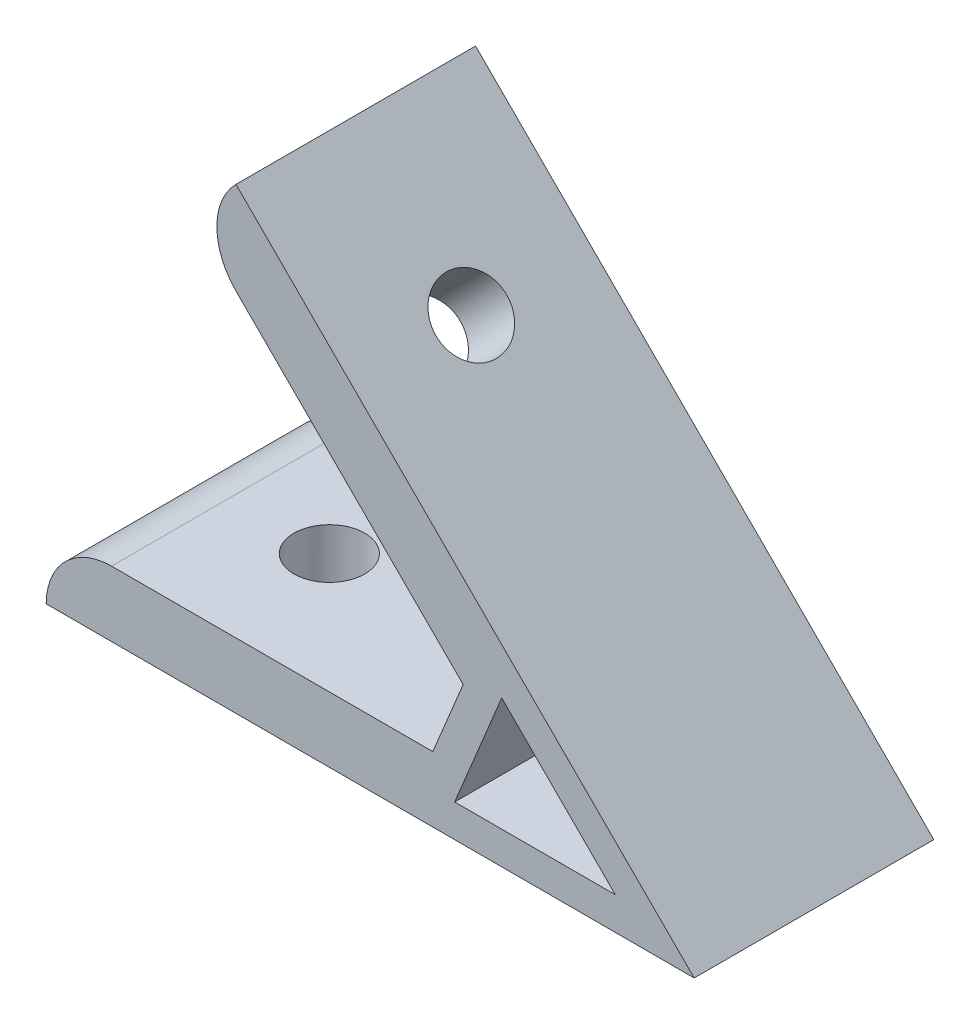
ISO-10303-21;
HEADER;
FILE_DESCRIPTION(('STEP AP214'),'2;1');
FILE_NAME('part.step','',(''),(''),'','','');
FILE_SCHEMA(('AUTOMOTIVE_DESIGN { 1 0 10303 214 1 1 1 1 }'));
ENDSEC;
DATA;
#1=APPLICATION_CONTEXT('core data for automotive mechanical design processes');
#2=APPLICATION_PROTOCOL_DEFINITION('international standard','automotive_design',2000,#1);
#3=PRODUCT_CONTEXT('',#1,'mechanical');
#4=PRODUCT('Part','Part','',(#3));
#5=PRODUCT_RELATED_PRODUCT_CATEGORY('part','',(#4));
#6=PRODUCT_DEFINITION_FORMATION('','',#4);
#7=PRODUCT_DEFINITION_CONTEXT('part definition',#1,'design');
#8=PRODUCT_DEFINITION('design','',#6,#7);
#9=PRODUCT_DEFINITION_SHAPE('','',#8);
#10=(LENGTH_UNIT() NAMED_UNIT(*) SI_UNIT(.MILLI.,.METRE.));
#11=(NAMED_UNIT(*) PLANE_ANGLE_UNIT() SI_UNIT($,.RADIAN.));
#12=(NAMED_UNIT(*) SI_UNIT($,.STERADIAN.) SOLID_ANGLE_UNIT());
#13=UNCERTAINTY_MEASURE_WITH_UNIT(LENGTH_MEASURE(1.E-05),#10,'distance_accuracy_value','');
#14=(GEOMETRIC_REPRESENTATION_CONTEXT(3) GLOBAL_UNCERTAINTY_ASSIGNED_CONTEXT((#13)) GLOBAL_UNIT_ASSIGNED_CONTEXT((#10,
#11,#12)) REPRESENTATION_CONTEXT('',''));
#15=CARTESIAN_POINT('',(0.,0.,0.));
#16=DIRECTION('',(0.,0.,1.));
#17=DIRECTION('',(1.,0.,0.));
#18=AXIS2_PLACEMENT_3D('',#15,#16,#17);
#19=CARTESIAN_POINT('',(0.,0.,11.));
#20=DIRECTION('',(0.,1.,0.));
#21=DIRECTION('',(0.,0.,1.));
#22=AXIS2_PLACEMENT_3D('',#19,#20,#21);
#23=PLANE('',#22);
#24=DIRECTION('',(1.,0.,0.));
#25=VECTOR('',#24,1.);
#26=CARTESIAN_POINT('',(0.,0.,-11.));
#27=LINE('',#26,#25);
#28=CARTESIAN_POINT('',(0.,0.,-11.));
#29=VERTEX_POINT('',#28);
#30=CARTESIAN_POINT('',(59.5,0.,-11.));
#31=VERTEX_POINT('',#30);
#32=EDGE_CURVE('E146',#29,#31,#27,.T.);
#33=ORIENTED_EDGE('',*,*,#32,.T.);
#34=DIRECTION('',(0.,0.,-1.));
#35=VECTOR('',#34,1.);
#36=CARTESIAN_POINT('',(59.5,0.,11.));
#37=LINE('',#36,#35);
#38=CARTESIAN_POINT('',(59.5,0.,11.));
#39=VERTEX_POINT('',#38);
#40=EDGE_CURVE('E177',#39,#31,#37,.T.);
#41=ORIENTED_EDGE('',*,*,#40,.F.);
#42=DIRECTION('',(1.,0.,0.));
#43=VECTOR('',#42,1.);
#44=CARTESIAN_POINT('',(0.,0.,11.));
#45=LINE('',#44,#43);
#46=CARTESIAN_POINT('',(0.,0.,11.));
#47=VERTEX_POINT('',#46);
#48=EDGE_CURVE('E148',#47,#39,#45,.T.);
#49=ORIENTED_EDGE('',*,*,#48,.F.);
#50=DIRECTION('',(0.,0.,-1.));
#51=VECTOR('',#50,1.);
#52=CARTESIAN_POINT('',(0.,0.,11.));
#53=LINE('',#52,#51);
#54=EDGE_CURVE('E180',#47,#29,#53,.T.);
#55=ORIENTED_EDGE('',*,*,#54,.T.);
#56=EDGE_LOOP('',(#33,#41,#49,#55));
#57=FACE_BOUND('',#56,.T.);
#58=CARTESIAN_POINT('',(15.,0.,0.));
#59=DIRECTION('',(0.,1.,0.));
#60=DIRECTION('',(-1.,0.,0.));
#61=AXIS2_PLACEMENT_3D('',#58,#59,#60);
#62=CIRCLE('',#61,3.25);
#63=CARTESIAN_POINT('',(11.75,0.,0.));
#64=VERTEX_POINT('',#63);
#65=EDGE_CURVE('E198',#64,#64,#62,.T.);
#66=ORIENTED_EDGE('',*,*,#65,.T.);
#67=EDGE_LOOP('',(#66));
#68=FACE_BOUND('',#67,.T.);
#69=ADVANCED_FACE('F31',(#57,#68),#23,.F.);
#70=CARTESIAN_POINT('',(35.5,6.,11.));
#71=DIRECTION('',(0.,-1.,0.));
#72=DIRECTION('',(1.,0.,0.));
#73=AXIS2_PLACEMENT_3D('',#70,#71,#72);
#74=PLANE('',#73);
#75=DIRECTION('',(-1.,0.,0.));
#76=VECTOR('',#75,1.);
#77=CARTESIAN_POINT('',(35.5,6.,-11.));
#78=LINE('',#77,#76);
#79=CARTESIAN_POINT('',(35.5,6.,-11.));
#80=VERTEX_POINT('',#79);
#81=CARTESIAN_POINT('',(6.,6.,-11.));
#82=VERTEX_POINT('',#81);
#83=EDGE_CURVE('E151',#80,#82,#78,.T.);
#84=ORIENTED_EDGE('',*,*,#83,.T.);
#85=DIRECTION('',(0.,0.,-1.));
#86=VECTOR('',#85,1.);
#87=CARTESIAN_POINT('',(6.,6.,11.));
#88=LINE('',#87,#86);
#89=CARTESIAN_POINT('',(6.,6.,11.));
#90=VERTEX_POINT('',#89);
#91=EDGE_CURVE('E40',#82,#90,#88,.F.);
#92=ORIENTED_EDGE('',*,*,#91,.T.);
#93=DIRECTION('',(-1.,0.,0.));
#94=VECTOR('',#93,1.);
#95=CARTESIAN_POINT('',(35.5,6.,11.));
#96=LINE('',#95,#94);
#97=CARTESIAN_POINT('',(35.5,6.,11.));
#98=VERTEX_POINT('',#97);
#99=EDGE_CURVE('E157',#98,#90,#96,.T.);
#100=ORIENTED_EDGE('',*,*,#99,.F.);
#101=DIRECTION('',(0.,0.,-1.));
#102=VECTOR('',#101,1.);
#103=CARTESIAN_POINT('',(35.5,6.,11.));
#104=LINE('',#103,#102);
#105=EDGE_CURVE('E159',#98,#80,#104,.T.);
#106=ORIENTED_EDGE('',*,*,#105,.T.);
#107=EDGE_LOOP('',(#84,#92,#100,#106));
#108=FACE_BOUND('',#107,.T.);
#109=CARTESIAN_POINT('',(15.,6.,0.));
#110=DIRECTION('',(0.,-1.,0.));
#111=DIRECTION('',(1.,0.,0.));
#112=AXIS2_PLACEMENT_3D('',#109,#110,#111);
#113=CIRCLE('',#112,3.25);
#114=CARTESIAN_POINT('',(18.25,6.,0.));
#115=VERTEX_POINT('',#114);
#116=EDGE_CURVE('E35',#115,#115,#113,.F.);
#117=ORIENTED_EDGE('',*,*,#116,.F.);
#118=EDGE_LOOP('',(#117));
#119=FACE_BOUND('',#118,.T.);
#120=ADVANCED_FACE('F214',(#108,#119),#74,.F.);
#121=CARTESIAN_POINT('',(59.5,0.,11.));
#122=DIRECTION('',(-0.707106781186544,-0.707106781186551,0.));
#123=DIRECTION('',(0.707106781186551,-0.707106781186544,0.));
#124=AXIS2_PLACEMENT_3D('',#121,#122,#123);
#125=PLANE('',#124);
#126=CARTESIAN_POINT('',(28.0337482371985,31.4662517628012,0.));
#127=DIRECTION('',(0.707106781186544,0.707106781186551,0.));
#128=DIRECTION('',(-0.707106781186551,0.707106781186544,0.));
#129=AXIS2_PLACEMENT_3D('',#126,#127,#128);
#130=CIRCLE('',#129,3.25);
#131=CARTESIAN_POINT('',(25.7356511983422,33.7643488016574,0.));
#132=VERTEX_POINT('',#131);
#133=EDGE_CURVE('E137',#132,#132,#130,.T.);
#134=ORIENTED_EDGE('',*,*,#133,.F.);
#135=EDGE_LOOP('',(#134));
#136=FACE_BOUND('',#135,.T.);
#137=DIRECTION('',(-0.707106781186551,0.707106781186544,0.));
#138=VECTOR('',#137,1.);
#139=CARTESIAN_POINT('',(59.5,0.,-11.));
#140=LINE('',#139,#138);
#141=CARTESIAN_POINT('',(17.4271465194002,42.0728534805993,-11.));
#142=VERTEX_POINT('',#141);
#143=EDGE_CURVE('E161',#31,#142,#140,.T.);
#144=ORIENTED_EDGE('',*,*,#143,.T.);
#145=DIRECTION('',(0.,0.,-1.));
#146=VECTOR('',#145,1.);
#147=CARTESIAN_POINT('',(17.4271465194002,42.0728534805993,11.));
#148=LINE('',#147,#146);
#149=CARTESIAN_POINT('',(17.4271465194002,42.0728534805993,11.));
#150=VERTEX_POINT('',#149);
#151=EDGE_CURVE('E174',#150,#142,#148,.T.);
#152=ORIENTED_EDGE('',*,*,#151,.F.);
#153=DIRECTION('',(-0.707106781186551,0.707106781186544,0.));
#154=VECTOR('',#153,1.);
#155=CARTESIAN_POINT('',(59.5,0.,11.));
#156=LINE('',#155,#154);
#157=EDGE_CURVE('E150',#39,#150,#156,.T.);
#158=ORIENTED_EDGE('',*,*,#157,.F.);
#159=ORIENTED_EDGE('',*,*,#40,.T.);
#160=EDGE_LOOP('',(#144,#152,#158,#159));
#161=FACE_BOUND('',#160,.T.);
#162=ADVANCED_FACE('F220',(#136,#161),#125,.F.);
#163=CARTESIAN_POINT('',(13.1845058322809,37.83021279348,11.));
#164=DIRECTION('',(0.707106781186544,0.707106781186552,0.));
#165=DIRECTION('',(-0.707106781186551,0.707106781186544,0.));
#166=AXIS2_PLACEMENT_3D('',#163,#164,#165);
#167=PLANE('',#166);
#168=CARTESIAN_POINT('',(23.7911075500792,27.2236110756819,0.));
#169=DIRECTION('',(0.707106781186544,0.707106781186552,0.));
#170=DIRECTION('',(-0.707106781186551,0.707106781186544,0.));
#171=AXIS2_PLACEMENT_3D('',#168,#169,#170);
#172=CIRCLE('',#171,3.25);
#173=CARTESIAN_POINT('',(21.4930105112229,29.5217081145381,0.));
#174=VERTEX_POINT('',#173);
#175=EDGE_CURVE('E142',#174,#174,#172,.T.);
#176=ORIENTED_EDGE('',*,*,#175,.T.);
#177=EDGE_LOOP('',(#176));
#178=FACE_BOUND('',#177,.T.);
#179=DIRECTION('',(0.707106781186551,-0.707106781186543,0.));
#180=VECTOR('',#179,1.);
#181=CARTESIAN_POINT('',(13.1845058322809,37.83021279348,11.));
#182=LINE('',#181,#180);
#183=CARTESIAN_POINT('',(17.4271465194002,33.5875721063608,11.));
#184=VERTEX_POINT('',#183);
#185=CARTESIAN_POINT('',(38.2867965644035,12.7279220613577,11.));
#186=VERTEX_POINT('',#185);
#187=EDGE_CURVE('E153',#184,#186,#182,.T.);
#188=ORIENTED_EDGE('',*,*,#187,.F.);
#189=DIRECTION('',(0.,0.,-1.));
#190=VECTOR('',#189,1.);
#191=CARTESIAN_POINT('',(17.4271465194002,33.5875721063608,11.));
#192=LINE('',#191,#190);
#193=CARTESIAN_POINT('',(17.4271465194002,33.5875721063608,-11.));
#194=VERTEX_POINT('',#193);
#195=EDGE_CURVE('E183',#184,#194,#192,.T.);
#196=ORIENTED_EDGE('',*,*,#195,.T.);
#197=DIRECTION('',(0.707106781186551,-0.707106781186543,0.));
#198=VECTOR('',#197,1.);
#199=CARTESIAN_POINT('',(13.1845058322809,37.83021279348,-11.));
#200=LINE('',#199,#198);
#201=CARTESIAN_POINT('',(38.2867965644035,12.7279220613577,-11.));
#202=VERTEX_POINT('',#201);
#203=EDGE_CURVE('E164',#194,#202,#200,.T.);
#204=ORIENTED_EDGE('',*,*,#203,.T.);
#205=DIRECTION('',(0.,0.,-1.));
#206=VECTOR('',#205,1.);
#207=CARTESIAN_POINT('',(38.2867965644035,12.7279220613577,11.));
#208=LINE('',#207,#206);
#209=EDGE_CURVE('E171',#186,#202,#208,.T.);
#210=ORIENTED_EDGE('',*,*,#209,.F.);
#211=EDGE_LOOP('',(#188,#196,#204,#210));
#212=FACE_BOUND('',#211,.T.);
#213=ADVANCED_FACE('F243',(#178,#212),#167,.F.);
#214=CARTESIAN_POINT('',(38.2867965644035,12.7279220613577,11.));
#215=DIRECTION('',(0.923879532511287,-0.382683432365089,0.));
#216=DIRECTION('',(0.382683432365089,0.923879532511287,0.));
#217=AXIS2_PLACEMENT_3D('',#214,#215,#216);
#218=PLANE('',#217);
#219=DIRECTION('',(-0.382683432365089,-0.923879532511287,0.));
#220=VECTOR('',#219,1.);
#221=CARTESIAN_POINT('',(38.2867965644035,12.7279220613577,-11.));
#222=LINE('',#221,#220);
#223=EDGE_CURVE('E166',#202,#80,#222,.T.);
#224=ORIENTED_EDGE('',*,*,#223,.T.);
#225=ORIENTED_EDGE('',*,*,#105,.F.);
#226=DIRECTION('',(-0.382683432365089,-0.923879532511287,0.));
#227=VECTOR('',#226,1.);
#228=CARTESIAN_POINT('',(38.2867965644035,12.7279220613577,11.));
#229=LINE('',#228,#227);
#230=EDGE_CURVE('E155',#186,#98,#229,.T.);
#231=ORIENTED_EDGE('',*,*,#230,.F.);
#232=ORIENTED_EDGE('',*,*,#209,.T.);
#233=EDGE_LOOP('',(#224,#225,#231,#232));
#234=FACE_BOUND('',#233,.T.);
#235=ADVANCED_FACE('F249',(#234),#218,.F.);
#236=CARTESIAN_POINT('',(0.,0.,11.));
#237=DIRECTION('',(0.,0.,1.));
#238=DIRECTION('',(1.,0.,0.));
#239=AXIS2_PLACEMENT_3D('',#236,#237,#238);
#240=PLANE('',#239);
#241=DIRECTION('',(-0.707106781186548,0.707106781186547,0.));
#242=VECTOR('',#241,1.);
#243=CARTESIAN_POINT('',(41.8255378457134,13.4318214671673,11.));
#244=LINE('',#243,#242);
#245=CARTESIAN_POINT('',(52.2573593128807,3.,11.));
#246=VERTEX_POINT('',#245);
#247=CARTESIAN_POINT('',(41.8255378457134,13.4318214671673,11.));
#248=VERTEX_POINT('',#247);
#249=EDGE_CURVE('E117',#246,#248,#244,.T.);
#250=ORIENTED_EDGE('',*,*,#249,.F.);
#251=DIRECTION('',(1.,0.,0.));
#252=VECTOR('',#251,1.);
#253=CARTESIAN_POINT('',(52.2573593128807,3.,11.));
#254=LINE('',#253,#252);
#255=CARTESIAN_POINT('',(37.5045359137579,3.,11.));
#256=VERTEX_POINT('',#255);
#257=EDGE_CURVE('E131',#256,#246,#254,.T.);
#258=ORIENTED_EDGE('',*,*,#257,.F.);
#259=DIRECTION('',(-0.382683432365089,-0.923879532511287,0.));
#260=VECTOR('',#259,1.);
#261=CARTESIAN_POINT('',(41.8255378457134,13.4318214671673,11.));
#262=LINE('',#261,#260);
#263=EDGE_CURVE('E134',#248,#256,#262,.T.);
#264=ORIENTED_EDGE('',*,*,#263,.F.);
#265=EDGE_LOOP('',(#250,#258,#264));
#266=FACE_BOUND('',#265,.T.);
#267=ORIENTED_EDGE('',*,*,#99,.T.);
#268=CARTESIAN_POINT('',(6.,0.,11.));
#269=DIRECTION('',(0.,0.,1.));
#270=DIRECTION('',(1.,0.,0.));
#271=AXIS2_PLACEMENT_3D('',#268,#269,#270);
#272=CIRCLE('',#271,6.);
#273=EDGE_CURVE('E11',#90,#47,#272,.T.);
#274=ORIENTED_EDGE('',*,*,#273,.T.);
#275=ORIENTED_EDGE('',*,*,#48,.T.);
#276=ORIENTED_EDGE('',*,*,#157,.T.);
#277=CARTESIAN_POINT('',(21.6697872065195,37.8302127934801,11.));
#278=DIRECTION('',(0.,0.,1.));
#279=DIRECTION('',(1.,0.,0.));
#280=AXIS2_PLACEMENT_3D('',#277,#278,#279);
#281=CIRCLE('',#280,6.);
#282=EDGE_CURVE('E188',#150,#184,#281,.T.);
#283=ORIENTED_EDGE('',*,*,#282,.T.);
#284=ORIENTED_EDGE('',*,*,#187,.T.);
#285=ORIENTED_EDGE('',*,*,#230,.T.);
#286=EDGE_LOOP('',(#267,#274,#275,#276,#283,#284,#285));
#287=FACE_BOUND('',#286,.T.);
#288=ADVANCED_FACE('F239',(#266,#287),#240,.T.);
#289=CARTESIAN_POINT('',(0.,0.,-11.));
#290=DIRECTION('',(0.,0.,1.));
#291=DIRECTION('',(1.,0.,0.));
#292=AXIS2_PLACEMENT_3D('',#289,#290,#291);
#293=PLANE('',#292);
#294=DIRECTION('',(1.,0.,0.));
#295=VECTOR('',#294,1.);
#296=CARTESIAN_POINT('',(52.2573593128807,3.,-11.));
#297=LINE('',#296,#295);
#298=CARTESIAN_POINT('',(37.5045359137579,3.,-11.));
#299=VERTEX_POINT('',#298);
#300=CARTESIAN_POINT('',(52.2573593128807,3.,-11.));
#301=VERTEX_POINT('',#300);
#302=EDGE_CURVE('E122',#299,#301,#297,.T.);
#303=ORIENTED_EDGE('',*,*,#302,.T.);
#304=DIRECTION('',(-0.707106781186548,0.707106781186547,0.));
#305=VECTOR('',#304,1.);
#306=CARTESIAN_POINT('',(41.8255378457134,13.4318214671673,-11.));
#307=LINE('',#306,#305);
#308=CARTESIAN_POINT('',(41.8255378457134,13.4318214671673,-11.));
#309=VERTEX_POINT('',#308);
#310=EDGE_CURVE('E114',#301,#309,#307,.T.);
#311=ORIENTED_EDGE('',*,*,#310,.T.);
#312=DIRECTION('',(-0.382683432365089,-0.923879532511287,0.));
#313=VECTOR('',#312,1.);
#314=CARTESIAN_POINT('',(41.8255378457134,13.4318214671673,-11.));
#315=LINE('',#314,#313);
#316=EDGE_CURVE('E126',#309,#299,#315,.T.);
#317=ORIENTED_EDGE('',*,*,#316,.T.);
#318=EDGE_LOOP('',(#303,#311,#317));
#319=FACE_BOUND('',#318,.T.);
#320=ORIENTED_EDGE('',*,*,#32,.F.);
#321=CARTESIAN_POINT('',(6.,0.,-11.));
#322=DIRECTION('',(0.,0.,1.));
#323=DIRECTION('',(1.,0.,0.));
#324=AXIS2_PLACEMENT_3D('',#321,#322,#323);
#325=CIRCLE('',#324,6.);
#326=EDGE_CURVE('E55',#29,#82,#325,.F.);
#327=ORIENTED_EDGE('',*,*,#326,.T.);
#328=ORIENTED_EDGE('',*,*,#83,.F.);
#329=ORIENTED_EDGE('',*,*,#223,.F.);
#330=ORIENTED_EDGE('',*,*,#203,.F.);
#331=CARTESIAN_POINT('',(21.6697872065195,37.8302127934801,-11.));
#332=DIRECTION('',(0.,0.,1.));
#333=DIRECTION('',(1.,0.,0.));
#334=AXIS2_PLACEMENT_3D('',#331,#332,#333);
#335=CIRCLE('',#334,6.);
#336=EDGE_CURVE('E186',#194,#142,#335,.F.);
#337=ORIENTED_EDGE('',*,*,#336,.T.);
#338=ORIENTED_EDGE('',*,*,#143,.F.);
#339=EDGE_LOOP('',(#320,#327,#328,#329,#330,#337,#338));
#340=FACE_BOUND('',#339,.T.);
#341=ADVANCED_FACE('F130',(#319,#340),#293,.F.);
#342=CARTESIAN_POINT('',(41.8255378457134,13.4318214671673,-11.));
#343=DIRECTION('',(0.707106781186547,0.707106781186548,0.));
#344=DIRECTION('',(-0.707106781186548,0.707106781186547,0.));
#345=AXIS2_PLACEMENT_3D('',#342,#343,#344);
#346=PLANE('',#345);
#347=ORIENTED_EDGE('',*,*,#249,.T.);
#348=DIRECTION('',(0.,0.,1.));
#349=VECTOR('',#348,1.);
#350=CARTESIAN_POINT('',(41.8255378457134,13.4318214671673,-11.));
#351=LINE('',#350,#349);
#352=EDGE_CURVE('E110',#309,#248,#351,.T.);
#353=ORIENTED_EDGE('',*,*,#352,.F.);
#354=ORIENTED_EDGE('',*,*,#310,.F.);
#355=DIRECTION('',(0.,0.,1.));
#356=VECTOR('',#355,1.);
#357=CARTESIAN_POINT('',(52.2573593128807,3.,-11.));
#358=LINE('',#357,#356);
#359=EDGE_CURVE('E144',#301,#246,#358,.T.);
#360=ORIENTED_EDGE('',*,*,#359,.T.);
#361=EDGE_LOOP('',(#347,#353,#354,#360));
#362=FACE_BOUND('',#361,.T.);
#363=ADVANCED_FACE('F112',(#362),#346,.F.);
#364=CARTESIAN_POINT('',(52.2573593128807,3.,-11.));
#365=DIRECTION('',(0.,-1.,0.));
#366=DIRECTION('',(1.,0.,0.));
#367=AXIS2_PLACEMENT_3D('',#364,#365,#366);
#368=PLANE('',#367);
#369=ORIENTED_EDGE('',*,*,#257,.T.);
#370=ORIENTED_EDGE('',*,*,#359,.F.);
#371=ORIENTED_EDGE('',*,*,#302,.F.);
#372=DIRECTION('',(0.,0.,1.));
#373=VECTOR('',#372,1.);
#374=CARTESIAN_POINT('',(37.5045359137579,3.,-11.));
#375=LINE('',#374,#373);
#376=EDGE_CURVE('E121',#299,#256,#375,.T.);
#377=ORIENTED_EDGE('',*,*,#376,.T.);
#378=EDGE_LOOP('',(#369,#370,#371,#377));
#379=FACE_BOUND('',#378,.T.);
#380=ADVANCED_FACE('F232',(#379),#368,.F.);
#381=CARTESIAN_POINT('',(41.8255378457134,13.4318214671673,-11.));
#382=DIRECTION('',(-0.923879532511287,0.382683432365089,0.));
#383=DIRECTION('',(-0.382683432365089,-0.923879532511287,0.));
#384=AXIS2_PLACEMENT_3D('',#381,#382,#383);
#385=PLANE('',#384);
#386=ORIENTED_EDGE('',*,*,#263,.T.);
#387=ORIENTED_EDGE('',*,*,#376,.F.);
#388=ORIENTED_EDGE('',*,*,#316,.F.);
#389=ORIENTED_EDGE('',*,*,#352,.T.);
#390=EDGE_LOOP('',(#386,#387,#388,#389));
#391=FACE_BOUND('',#390,.T.);
#392=ADVANCED_FACE('F127',(#391),#385,.F.);
#393=CARTESIAN_POINT('',(21.6697872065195,37.8302127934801,11.));
#394=DIRECTION('',(0.,0.,-1.));
#395=DIRECTION('',(-1.,0.,0.));
#396=AXIS2_PLACEMENT_3D('',#393,#394,#395);
#397=CYLINDRICAL_SURFACE('',#396,6.);
#398=ORIENTED_EDGE('',*,*,#282,.F.);
#399=ORIENTED_EDGE('',*,*,#151,.T.);
#400=ORIENTED_EDGE('',*,*,#336,.F.);
#401=ORIENTED_EDGE('',*,*,#195,.F.);
#402=EDGE_LOOP('',(#398,#399,#400,#401));
#403=FACE_BOUND('',#402,.T.);
#404=ADVANCED_FACE('F224',(#403),#397,.T.);
#405=CARTESIAN_POINT('',(6.,0.,11.));
#406=DIRECTION('',(0.,0.,-1.));
#407=DIRECTION('',(-1.,0.,0.));
#408=AXIS2_PLACEMENT_3D('',#405,#406,#407);
#409=CYLINDRICAL_SURFACE('',#408,6.);
#410=ORIENTED_EDGE('',*,*,#273,.F.);
#411=ORIENTED_EDGE('',*,*,#91,.F.);
#412=ORIENTED_EDGE('',*,*,#326,.F.);
#413=ORIENTED_EDGE('',*,*,#54,.F.);
#414=EDGE_LOOP('',(#410,#411,#412,#413));
#415=FACE_BOUND('',#414,.T.);
#416=ADVANCED_FACE('F33',(#415),#409,.T.);
#417=CARTESIAN_POINT('',(5.40633123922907,8.83883476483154,0.));
#418=DIRECTION('',(0.707106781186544,0.707106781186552,0.));
#419=DIRECTION('',(-0.707106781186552,0.707106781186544,0.));
#420=AXIS2_PLACEMENT_3D('',#417,#418,#419);
#421=CYLINDRICAL_SURFACE('',#420,3.25);
#422=ORIENTED_EDGE('',*,*,#133,.T.);
#423=EDGE_LOOP('',(#422));
#424=FACE_BOUND('',#423,.T.);
#425=ORIENTED_EDGE('',*,*,#175,.F.);
#426=EDGE_LOOP('',(#425));
#427=FACE_BOUND('',#426,.T.);
#428=ADVANCED_FACE('F207',(#424,#427),#421,.F.);
#429=CARTESIAN_POINT('',(15.,32.,0.));
#430=DIRECTION('',(0.,-1.,0.));
#431=DIRECTION('',(1.,0.,0.));
#432=AXIS2_PLACEMENT_3D('',#429,#430,#431);
#433=CYLINDRICAL_SURFACE('',#432,3.25);
#434=ORIENTED_EDGE('',*,*,#65,.F.);
#435=EDGE_LOOP('',(#434));
#436=FACE_BOUND('',#435,.T.);
#437=ORIENTED_EDGE('',*,*,#116,.T.);
#438=EDGE_LOOP('',(#437));
#439=FACE_BOUND('',#438,.T.);
#440=ADVANCED_FACE('F205',(#436,#439),#433,.F.);
#441=CLOSED_SHELL('',(#69,#120,#162,#213,#235,#288,#341,#363,#380,#392,#404,#416,#428,#440));
#442=MANIFOLD_SOLID_BREP('B2',#441);
#443=ADVANCED_BREP_SHAPE_REPRESENTATION('',(#18,#442),#14);
#444=SHAPE_DEFINITION_REPRESENTATION(#9,#443);
ENDSEC;
END-ISO-10303-21;
